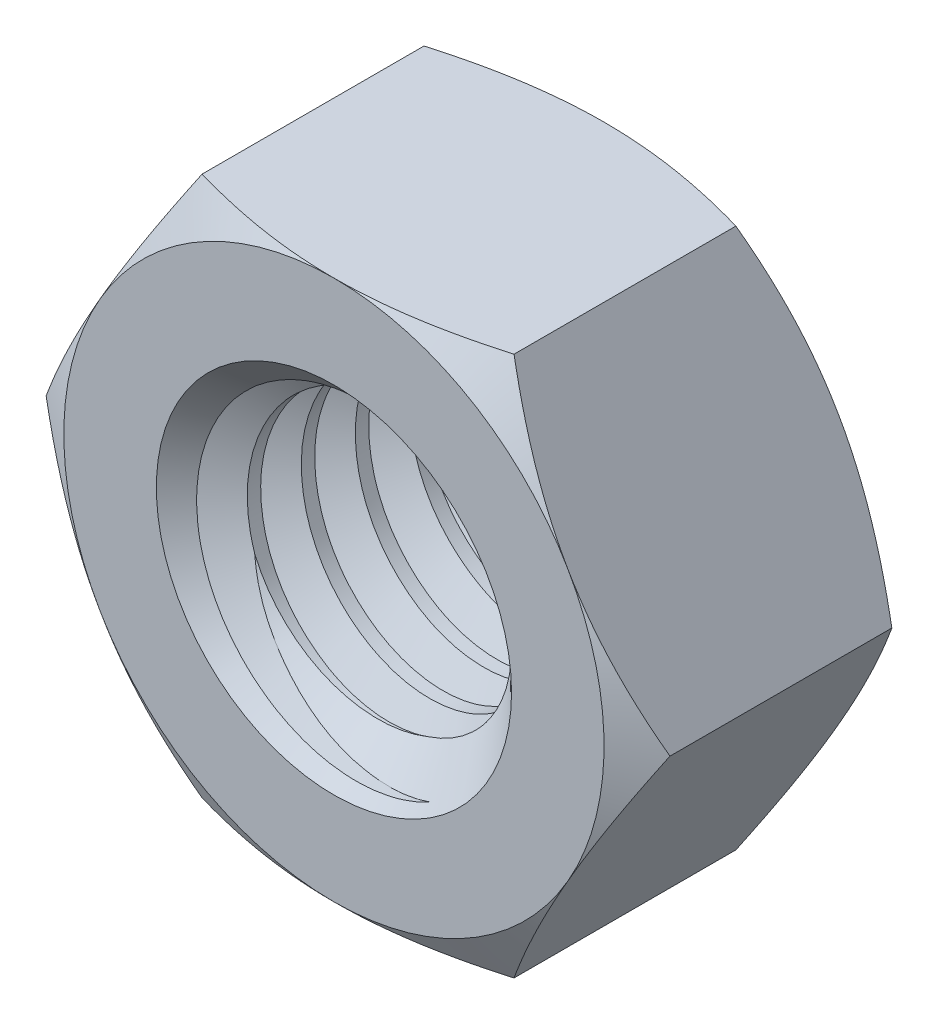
from build123d import *

# Parameters (mm, degrees)
Y_KSEKLIK_EKSTR_ZYON1_DEPTH = 4
IZIM2_OUTSIDE_W             = 27.666
IZIM2_OUTSIDE_H             = 26.428
IZIM2_OUTSIDE_R             = 4
KES_EKSTR_ZYON1_DEPTH       = 4
KES_EKSTR_ZYON1_DRAFT       = -60
IZIM3_OUTSIDE_W             = 27.666
IZIM3_OUTSIDE_H             = 26.428
IZIM3_OUTSIDE_R             = 4
KES_EKSTR_ZYON2_DEPTH       = 4
KES_EKSTR_ZYON2_DRAFT       = -60
IZIM4_R                     = 1.98
KES_EKSTR_ZYON3_DEPTH       = 4
PAH1_SIZE                   = 0.65
KES_S_P_R1_PITCH            = 0.8
KES_S_P_R1_HEIGHT           = 5
KES_S_P_R1_RADIUS           = 1.98


with BuildPart() as part:
    # izim1 → Y_kseklik-Ekstr_zyon1 (new body)
    with BuildSketch(Plane.XY):
        Polygon((4.618802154, 0), (2.309401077, 4), (-2.309401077, 4), (-4.618802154, 0), (-2.309401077, -4), (2.309401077, -4), align=None)
    extrude(amount=Y_KSEKLIK_EKSTR_ZYON1_DEPTH)


with BuildPart() as kes_ekstr_zyon1_tool:
    # izim2 outside → Kes-Ekstr_zyon1 (with draft: the straight prism first)
    with BuildSketch(Plane.XY.offset(4)):
        Rectangle(IZIM2_OUTSIDE_W, IZIM2_OUTSIDE_H)
        Circle(IZIM2_OUTSIDE_R, mode=Mode.SUBTRACT)
    extrude(amount=-KES_EKSTR_ZYON1_DEPTH)
    # Kes-Ekstr_zyon1: the draft: its side faces are tilted about the plane it starts from
    kes_ekstr_zyon1_sides = [kes_ekstr_zyon1_tool.faces().sort_by_distance(p)[0] for p in [
        (0, -13.214, 2),
        (13.833, 0, 2),
        (0, 13.214, 2),
        (-13.833, 0, 2),
        (-4, 0, 2),
    ]]
    draft(kes_ekstr_zyon1_sides, Plane.XY.offset(4), KES_EKSTR_ZYON1_DRAFT)


with BuildPart() as part_1:
    add(part.part)

    # Kes-Ekstr_zyon1: cut by kes_ekstr_zyon1_tool
    add(kes_ekstr_zyon1_tool.part, mode=Mode.SUBTRACT)


with BuildPart() as kes_ekstr_zyon2_tool:
    # izim3 outside → Kes-Ekstr_zyon2 (with draft: the straight prism first)
    with BuildSketch(Plane(origin=(0, 0, 0), x_dir=(-1, 0, 0), z_dir=(0, 0, -1))):
        Rectangle(IZIM3_OUTSIDE_W, IZIM3_OUTSIDE_H)
        Circle(IZIM3_OUTSIDE_R, mode=Mode.SUBTRACT)
    extrude(amount=-KES_EKSTR_ZYON2_DEPTH)
    # Kes-Ekstr_zyon2: the draft: its side faces are tilted about the plane it starts from
    kes_ekstr_zyon2_sides = [kes_ekstr_zyon2_tool.faces().sort_by_distance(p)[0] for p in [
        (0, -13.214, 2),
        (-13.833, 0, 2),
        (0, 13.214, 2),
        (13.833, 0, 2),
        (4, 0, 2),
    ]]
    draft(kes_ekstr_zyon2_sides, Plane(origin=(0, 0, 0), x_dir=(-1, 0, 0), z_dir=(0, 0, -1)), KES_EKSTR_ZYON2_DRAFT)


with BuildPart() as part_2:
    add(part_1.part)

    # Kes-Ekstr_zyon2: cut by kes_ekstr_zyon2_tool
    add(kes_ekstr_zyon2_tool.part, mode=Mode.SUBTRACT)

    # izim4 → Kes-Ekstr_zyon3 (cut)
    with BuildSketch(Plane.XY.offset(4)):
        Circle(IZIM4_R)
    extrude(amount=-KES_EKSTR_ZYON3_DEPTH, mode=Mode.SUBTRACT)

    # Pah1
    pah1_edges = [part_2.edges().sort_by_distance(p)[0] for p in [
        (-1.98, 0, 0),
        (-1.98, 0, 4),
    ]]
    chamfer(pah1_edges, length=PAH1_SIZE)

    # Kes-S_p_r1: sweep along a helix
    with BuildLine() as kes_s_p_r1_path:
        Helix(KES_S_P_R1_PITCH, KES_S_P_R1_HEIGHT, KES_S_P_R1_RADIUS, center=(0, 0, 0), direction=(0, 0, 1))
    # izim6 → Kes-S_p_r1 (sweep, cut)
    with BuildSketch(Plane(origin=(0, 1.98, 5), x_dir=(0.06417248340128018, 5.079204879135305e-15, 0.9979388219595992), z_dir=(-0.9979388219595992, -7.898612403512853e-14, 0.06417248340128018))):
        Polygon((0, 0.52), (-0.383328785, -0.143944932), (0.383328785, -0.143944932), align=None)
    sweep(path=kes_s_p_r1_path.line, is_frenet=True, mode=Mode.SUBTRACT)


solid = part_2.part
